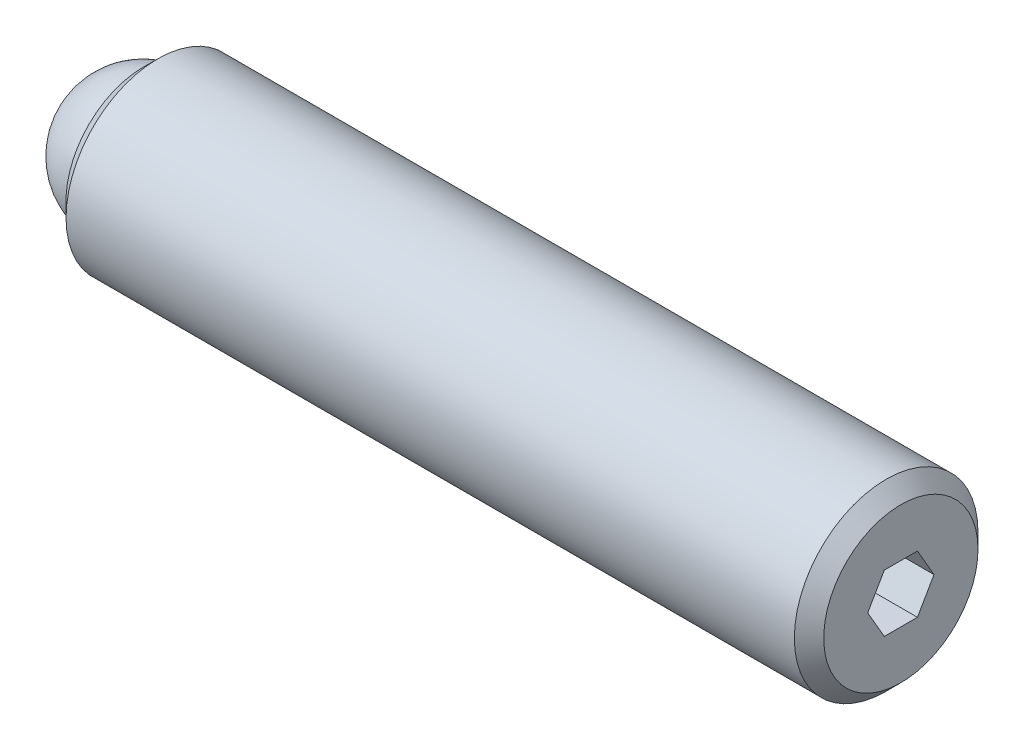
ISO-10303-21;
HEADER;
FILE_DESCRIPTION(('STEP AP214'),'2;1');
FILE_NAME('part.step','',(''),(''),'','','');
FILE_SCHEMA(('AUTOMOTIVE_DESIGN { 1 0 10303 214 1 1 1 1 }'));
ENDSEC;
DATA;
#1=APPLICATION_CONTEXT('core data for automotive mechanical design processes');
#2=APPLICATION_PROTOCOL_DEFINITION('international standard','automotive_design',2000,#1);
#3=PRODUCT_CONTEXT('',#1,'mechanical');
#4=PRODUCT('Part','Part','',(#3));
#5=PRODUCT_RELATED_PRODUCT_CATEGORY('part','',(#4));
#6=PRODUCT_DEFINITION_FORMATION('','',#4);
#7=PRODUCT_DEFINITION_CONTEXT('part definition',#1,'design');
#8=PRODUCT_DEFINITION('design','',#6,#7);
#9=PRODUCT_DEFINITION_SHAPE('','',#8);
#10=(LENGTH_UNIT() NAMED_UNIT(*) SI_UNIT(.MILLI.,.METRE.));
#11=(NAMED_UNIT(*) PLANE_ANGLE_UNIT() SI_UNIT($,.RADIAN.));
#12=(NAMED_UNIT(*) SI_UNIT($,.STERADIAN.) SOLID_ANGLE_UNIT());
#13=UNCERTAINTY_MEASURE_WITH_UNIT(LENGTH_MEASURE(1.E-05),#10,'distance_accuracy_value','');
#14=(GEOMETRIC_REPRESENTATION_CONTEXT(3) GLOBAL_UNCERTAINTY_ASSIGNED_CONTEXT((#13)) GLOBAL_UNIT_ASSIGNED_CONTEXT((#10,
#11,#12)) REPRESENTATION_CONTEXT('',''));
#15=CARTESIAN_POINT('',(0.,0.,0.));
#16=DIRECTION('',(0.,0.,1.));
#17=DIRECTION('',(1.,0.,0.));
#18=AXIS2_PLACEMENT_3D('',#15,#16,#17);
#19=CARTESIAN_POINT('',(0.,0.,0.));
#20=DIRECTION('',(0.,-1.,0.));
#21=DIRECTION('',(0.,0.,1.));
#22=AXIS2_PLACEMENT_3D('',#19,#20,#21);
#23=SPHERICAL_SURFACE('',#22,2.38125);
#24=CARTESIAN_POINT('',(0.,-2.38125,0.));
#25=VERTEX_POINT('',#24);
#26=VERTEX_LOOP('',#25);
#27=FACE_BOUND('',#26,.T.);
#28=ADVANCED_FACE('F41',(#27),#23,.T.);
#29=CLOSED_SHELL('',(#28));
#30=MANIFOLD_SOLID_BREP('B2',#29);
#31=CARTESIAN_POINT('',(26.19375,0.,0.));
#32=DIRECTION('',(-1.,0.,0.));
#33=DIRECTION('',(0.,0.,1.));
#34=AXIS2_PLACEMENT_3D('',#31,#32,#33);
#35=CYLINDRICAL_SURFACE('',#34,3.175);
#36=CARTESIAN_POINT('',(25.68575,0.,0.));
#37=DIRECTION('',(1.,0.,0.));
#38=DIRECTION('',(0.,0.,-1.));
#39=AXIS2_PLACEMENT_3D('',#36,#37,#38);
#40=CIRCLE('',#39,3.175);
#41=CARTESIAN_POINT('',(25.68575,0.,-3.175));
#42=VERTEX_POINT('',#41);
#43=EDGE_CURVE('E39',#42,#42,#40,.F.);
#44=ORIENTED_EDGE('',*,*,#43,.T.);
#45=EDGE_LOOP('',(#44));
#46=FACE_BOUND('',#45,.T.);
#47=CARTESIAN_POINT('',(0.508000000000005,0.,0.));
#48=DIRECTION('',(1.,0.,0.));
#49=DIRECTION('',(0.,0.,-1.));
#50=AXIS2_PLACEMENT_3D('',#47,#48,#49);
#51=CIRCLE('',#50,3.175);
#52=CARTESIAN_POINT('',(0.508000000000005,0.,-3.175));
#53=VERTEX_POINT('',#52);
#54=EDGE_CURVE('E157',#53,#53,#51,.T.);
#55=ORIENTED_EDGE('',*,*,#54,.T.);
#56=EDGE_LOOP('',(#55));
#57=FACE_BOUND('',#56,.T.);
#58=ADVANCED_FACE('F54',(#46,#57),#35,.T.);
#59=CARTESIAN_POINT('',(26.19375,0.,0.));
#60=DIRECTION('',(1.,0.,0.));
#61=DIRECTION('',(0.,0.,-1.));
#62=AXIS2_PLACEMENT_3D('',#59,#60,#61);
#63=PLANE('',#62);
#64=DIRECTION('',(0.,0.866025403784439,-0.5));
#65=VECTOR('',#64,1.);
#66=CARTESIAN_POINT('',(26.19375,-0.9921875,-0.572839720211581));
#67=LINE('',#66,#65);
#68=CARTESIAN_POINT('',(26.19375,-0.9921875,-0.572839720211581));
#69=VERTEX_POINT('',#68);
#70=CARTESIAN_POINT('',(26.19375,0.,-1.14567944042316));
#71=VERTEX_POINT('',#70);
#72=EDGE_CURVE('E69',#69,#71,#67,.T.);
#73=ORIENTED_EDGE('',*,*,#72,.F.);
#74=DIRECTION('',(0.,0.,-1.));
#75=VECTOR('',#74,1.);
#76=CARTESIAN_POINT('',(26.19375,-0.9921875,0.572839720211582));
#77=LINE('',#76,#75);
#78=CARTESIAN_POINT('',(26.19375,-0.9921875,0.572839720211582));
#79=VERTEX_POINT('',#78);
#80=EDGE_CURVE('E153',#79,#69,#77,.T.);
#81=ORIENTED_EDGE('',*,*,#80,.F.);
#82=DIRECTION('',(0.,-0.866025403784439,-0.5));
#83=VECTOR('',#82,1.);
#84=CARTESIAN_POINT('',(26.19375,0.,1.14567944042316));
#85=LINE('',#84,#83);
#86=CARTESIAN_POINT('',(26.19375,0.,1.14567944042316));
#87=VERTEX_POINT('',#86);
#88=EDGE_CURVE('E151',#87,#79,#85,.T.);
#89=ORIENTED_EDGE('',*,*,#88,.F.);
#90=DIRECTION('',(0.,-0.866025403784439,0.5));
#91=VECTOR('',#90,1.);
#92=CARTESIAN_POINT('',(26.19375,0.992187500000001,0.572839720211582));
#93=LINE('',#92,#91);
#94=CARTESIAN_POINT('',(26.19375,0.992187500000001,0.572839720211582));
#95=VERTEX_POINT('',#94);
#96=EDGE_CURVE('E117',#95,#87,#93,.T.);
#97=ORIENTED_EDGE('',*,*,#96,.F.);
#98=DIRECTION('',(0.,0.,1.));
#99=VECTOR('',#98,1.);
#100=CARTESIAN_POINT('',(26.19375,0.9921875,-0.572839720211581));
#101=LINE('',#100,#99);
#102=CARTESIAN_POINT('',(26.19375,0.9921875,-0.572839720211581));
#103=VERTEX_POINT('',#102);
#104=EDGE_CURVE('E147',#103,#95,#101,.T.);
#105=ORIENTED_EDGE('',*,*,#104,.F.);
#106=DIRECTION('',(0.,0.866025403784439,0.5));
#107=VECTOR('',#106,1.);
#108=CARTESIAN_POINT('',(26.19375,0.,-1.14567944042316));
#109=LINE('',#108,#107);
#110=EDGE_CURVE('E143',#71,#103,#109,.T.);
#111=ORIENTED_EDGE('',*,*,#110,.F.);
#112=EDGE_LOOP('',(#73,#81,#89,#97,#105,#111));
#113=FACE_BOUND('',#112,.T.);
#114=CARTESIAN_POINT('',(26.19375,0.,0.));
#115=DIRECTION('',(1.,0.,0.));
#116=DIRECTION('',(0.,0.,-1.));
#117=AXIS2_PLACEMENT_3D('',#114,#115,#116);
#118=CIRCLE('',#117,2.667);
#119=CARTESIAN_POINT('',(26.19375,0.,-2.667));
#120=VERTEX_POINT('',#119);
#121=EDGE_CURVE('E62',#120,#120,#118,.T.);
#122=ORIENTED_EDGE('',*,*,#121,.T.);
#123=EDGE_LOOP('',(#122));
#124=FACE_BOUND('',#123,.T.);
#125=ADVANCED_FACE('F170',(#113,#124),#63,.T.);
#126=CARTESIAN_POINT('',(0.,0.,0.));
#127=DIRECTION('',(1.,0.,0.));
#128=DIRECTION('',(0.,0.,-1.));
#129=AXIS2_PLACEMENT_3D('',#126,#127,#128);
#130=PLANE('',#129);
#131=CARTESIAN_POINT('',(0.,0.,0.));
#132=DIRECTION('',(-1.,0.,0.));
#133=DIRECTION('',(0.,0.,1.));
#134=AXIS2_PLACEMENT_3D('',#131,#132,#133);
#135=CIRCLE('',#134,2.38125);
#136=CARTESIAN_POINT('',(0.,0.,2.38125));
#137=VERTEX_POINT('',#136);
#138=EDGE_CURVE('E225',#137,#137,#135,.T.);
#139=ORIENTED_EDGE('',*,*,#138,.F.);
#140=EDGE_LOOP('',(#139));
#141=FACE_BOUND('',#140,.T.);
#142=CARTESIAN_POINT('',(0.,0.,0.));
#143=DIRECTION('',(1.,0.,0.));
#144=DIRECTION('',(0.,0.,-1.));
#145=AXIS2_PLACEMENT_3D('',#142,#143,#144);
#146=CIRCLE('',#145,2.667);
#147=CARTESIAN_POINT('',(0.,0.,-2.667));
#148=VERTEX_POINT('',#147);
#149=EDGE_CURVE('E165',#148,#148,#146,.F.);
#150=ORIENTED_EDGE('',*,*,#149,.T.);
#151=EDGE_LOOP('',(#150));
#152=FACE_BOUND('',#151,.T.);
#153=ADVANCED_FACE('F182',(#141,#152),#130,.F.);
#154=CARTESIAN_POINT('',(0.508000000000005,0.,0.));
#155=DIRECTION('',(1.,0.,0.));
#156=DIRECTION('',(0.,0.,-1.));
#157=AXIS2_PLACEMENT_3D('',#154,#155,#156);
#158=CONICAL_SURFACE('',#157,3.175,0.785398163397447);
#159=ORIENTED_EDGE('',*,*,#149,.F.);
#160=EDGE_LOOP('',(#159));
#161=FACE_BOUND('',#160,.T.);
#162=ORIENTED_EDGE('',*,*,#54,.F.);
#163=EDGE_LOOP('',(#162));
#164=FACE_BOUND('',#163,.T.);
#165=ADVANCED_FACE('F174',(#161,#164),#158,.T.);
#166=CARTESIAN_POINT('',(26.19375,0.,0.));
#167=DIRECTION('',(-1.,0.,0.));
#168=DIRECTION('',(0.,0.,1.));
#169=AXIS2_PLACEMENT_3D('',#166,#167,#168);
#170=CONICAL_SURFACE('',#169,2.667,0.785398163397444);
#171=ORIENTED_EDGE('',*,*,#43,.F.);
#172=EDGE_LOOP('',(#171));
#173=FACE_BOUND('',#172,.T.);
#174=ORIENTED_EDGE('',*,*,#121,.F.);
#175=EDGE_LOOP('',(#174));
#176=FACE_BOUND('',#175,.T.);
#177=ADVANCED_FACE('F56',(#173,#176),#170,.T.);
#178=CARTESIAN_POINT('',(23.90775,-0.9921875,-0.572839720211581));
#179=DIRECTION('',(0.,-0.5,-0.866025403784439));
#180=DIRECTION('',(0.,0.866025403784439,-0.5));
#181=AXIS2_PLACEMENT_3D('',#178,#179,#180);
#182=PLANE('',#181);
#183=ORIENTED_EDGE('',*,*,#72,.T.);
#184=DIRECTION('',(1.,0.,0.));
#185=VECTOR('',#184,1.);
#186=CARTESIAN_POINT('',(23.90775,0.,-1.14567944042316));
#187=LINE('',#186,#185);
#188=CARTESIAN_POINT('',(23.90775,0.,-1.14567944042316));
#189=VERTEX_POINT('',#188);
#190=EDGE_CURVE('E99',#189,#71,#187,.T.);
#191=ORIENTED_EDGE('',*,*,#190,.F.);
#192=DIRECTION('',(0.,0.866025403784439,-0.5));
#193=VECTOR('',#192,1.);
#194=CARTESIAN_POINT('',(23.90775,-0.9921875,-0.572839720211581));
#195=LINE('',#194,#193);
#196=CARTESIAN_POINT('',(23.90775,-0.9921875,-0.572839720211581));
#197=VERTEX_POINT('',#196);
#198=EDGE_CURVE('E155',#197,#189,#195,.T.);
#199=ORIENTED_EDGE('',*,*,#198,.F.);
#200=DIRECTION('',(1.,0.,0.));
#201=VECTOR('',#200,1.);
#202=CARTESIAN_POINT('',(23.90775,-0.9921875,-0.572839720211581));
#203=LINE('',#202,#201);
#204=EDGE_CURVE('E77',#197,#69,#203,.T.);
#205=ORIENTED_EDGE('',*,*,#204,.T.);
#206=EDGE_LOOP('',(#183,#191,#199,#205));
#207=FACE_BOUND('',#206,.T.);
#208=ADVANCED_FACE('F173',(#207),#182,.F.);
#209=CARTESIAN_POINT('',(23.90775,-0.9921875,0.572839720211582));
#210=DIRECTION('',(0.,-1.,0.));
#211=DIRECTION('',(0.,0.,-1.));
#212=AXIS2_PLACEMENT_3D('',#209,#210,#211);
#213=PLANE('',#212);
#214=ORIENTED_EDGE('',*,*,#80,.T.);
#215=ORIENTED_EDGE('',*,*,#204,.F.);
#216=DIRECTION('',(0.,0.,-1.));
#217=VECTOR('',#216,1.);
#218=CARTESIAN_POINT('',(23.90775,-0.9921875,0.572839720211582));
#219=LINE('',#218,#217);
#220=CARTESIAN_POINT('',(23.90775,-0.9921875,0.572839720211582));
#221=VERTEX_POINT('',#220);
#222=EDGE_CURVE('E129',#221,#197,#219,.T.);
#223=ORIENTED_EDGE('',*,*,#222,.F.);
#224=DIRECTION('',(1.,0.,0.));
#225=VECTOR('',#224,1.);
#226=CARTESIAN_POINT('',(23.90775,-0.9921875,0.572839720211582));
#227=LINE('',#226,#225);
#228=EDGE_CURVE('E121',#221,#79,#227,.T.);
#229=ORIENTED_EDGE('',*,*,#228,.T.);
#230=EDGE_LOOP('',(#214,#215,#223,#229));
#231=FACE_BOUND('',#230,.T.);
#232=ADVANCED_FACE('F180',(#231),#213,.F.);
#233=CARTESIAN_POINT('',(23.90775,0.,1.14567944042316));
#234=DIRECTION('',(0.,-0.5,0.866025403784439));
#235=DIRECTION('',(0.,-0.866025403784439,-0.5));
#236=AXIS2_PLACEMENT_3D('',#233,#234,#235);
#237=PLANE('',#236);
#238=ORIENTED_EDGE('',*,*,#88,.T.);
#239=ORIENTED_EDGE('',*,*,#228,.F.);
#240=DIRECTION('',(0.,-0.866025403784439,-0.5));
#241=VECTOR('',#240,1.);
#242=CARTESIAN_POINT('',(23.90775,0.,1.14567944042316));
#243=LINE('',#242,#241);
#244=CARTESIAN_POINT('',(23.90775,0.,1.14567944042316));
#245=VERTEX_POINT('',#244);
#246=EDGE_CURVE('E125',#245,#221,#243,.T.);
#247=ORIENTED_EDGE('',*,*,#246,.F.);
#248=DIRECTION('',(1.,0.,0.));
#249=VECTOR('',#248,1.);
#250=CARTESIAN_POINT('',(23.90775,0.,1.14567944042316));
#251=LINE('',#250,#249);
#252=EDGE_CURVE('E110',#245,#87,#251,.T.);
#253=ORIENTED_EDGE('',*,*,#252,.T.);
#254=EDGE_LOOP('',(#238,#239,#247,#253));
#255=FACE_BOUND('',#254,.T.);
#256=ADVANCED_FACE('F126',(#255),#237,.F.);
#257=CARTESIAN_POINT('',(23.90775,0.992187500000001,0.572839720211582));
#258=DIRECTION('',(0.,0.5,0.866025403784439));
#259=DIRECTION('',(0.,-0.866025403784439,0.5));
#260=AXIS2_PLACEMENT_3D('',#257,#258,#259);
#261=PLANE('',#260);
#262=ORIENTED_EDGE('',*,*,#96,.T.);
#263=ORIENTED_EDGE('',*,*,#252,.F.);
#264=DIRECTION('',(0.,-0.866025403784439,0.5));
#265=VECTOR('',#264,1.);
#266=CARTESIAN_POINT('',(23.90775,0.992187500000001,0.572839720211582));
#267=LINE('',#266,#265);
#268=CARTESIAN_POINT('',(23.90775,0.992187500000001,0.572839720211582));
#269=VERTEX_POINT('',#268);
#270=EDGE_CURVE('E114',#269,#245,#267,.T.);
#271=ORIENTED_EDGE('',*,*,#270,.F.);
#272=DIRECTION('',(1.,0.,0.));
#273=VECTOR('',#272,1.);
#274=CARTESIAN_POINT('',(23.90775,0.992187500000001,0.572839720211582));
#275=LINE('',#274,#273);
#276=EDGE_CURVE('E122',#269,#95,#275,.T.);
#277=ORIENTED_EDGE('',*,*,#276,.T.);
#278=EDGE_LOOP('',(#262,#263,#271,#277));
#279=FACE_BOUND('',#278,.T.);
#280=ADVANCED_FACE('F112',(#279),#261,.F.);
#281=CARTESIAN_POINT('',(23.90775,0.9921875,-0.572839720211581));
#282=DIRECTION('',(0.,1.,0.));
#283=DIRECTION('',(0.,0.,1.));
#284=AXIS2_PLACEMENT_3D('',#281,#282,#283);
#285=PLANE('',#284);
#286=ORIENTED_EDGE('',*,*,#104,.T.);
#287=ORIENTED_EDGE('',*,*,#276,.F.);
#288=DIRECTION('',(0.,0.,1.));
#289=VECTOR('',#288,1.);
#290=CARTESIAN_POINT('',(23.90775,0.9921875,-0.572839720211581));
#291=LINE('',#290,#289);
#292=CARTESIAN_POINT('',(23.90775,0.9921875,-0.572839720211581));
#293=VERTEX_POINT('',#292);
#294=EDGE_CURVE('E135',#293,#269,#291,.T.);
#295=ORIENTED_EDGE('',*,*,#294,.F.);
#296=DIRECTION('',(1.,0.,0.));
#297=VECTOR('',#296,1.);
#298=CARTESIAN_POINT('',(23.90775,0.9921875,-0.572839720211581));
#299=LINE('',#298,#297);
#300=EDGE_CURVE('E160',#293,#103,#299,.T.);
#301=ORIENTED_EDGE('',*,*,#300,.T.);
#302=EDGE_LOOP('',(#286,#287,#295,#301));
#303=FACE_BOUND('',#302,.T.);
#304=ADVANCED_FACE('F201',(#303),#285,.F.);
#305=CARTESIAN_POINT('',(23.90775,0.,-1.14567944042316));
#306=DIRECTION('',(0.,0.5,-0.866025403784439));
#307=DIRECTION('',(0.,0.866025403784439,0.5));
#308=AXIS2_PLACEMENT_3D('',#305,#306,#307);
#309=PLANE('',#308);
#310=ORIENTED_EDGE('',*,*,#110,.T.);
#311=ORIENTED_EDGE('',*,*,#300,.F.);
#312=DIRECTION('',(0.,0.866025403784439,0.5));
#313=VECTOR('',#312,1.);
#314=CARTESIAN_POINT('',(23.90775,0.,-1.14567944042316));
#315=LINE('',#314,#313);
#316=EDGE_CURVE('E137',#189,#293,#315,.T.);
#317=ORIENTED_EDGE('',*,*,#316,.F.);
#318=ORIENTED_EDGE('',*,*,#190,.T.);
#319=EDGE_LOOP('',(#310,#311,#317,#318));
#320=FACE_BOUND('',#319,.T.);
#321=ADVANCED_FACE('F198',(#320),#309,.F.);
#322=CARTESIAN_POINT('',(23.90775,0.,0.));
#323=DIRECTION('',(1.,0.,0.));
#324=DIRECTION('',(0.,0.,-1.));
#325=AXIS2_PLACEMENT_3D('',#322,#323,#324);
#326=PLANE('',#325);
#327=ORIENTED_EDGE('',*,*,#198,.T.);
#328=ORIENTED_EDGE('',*,*,#316,.T.);
#329=ORIENTED_EDGE('',*,*,#294,.T.);
#330=ORIENTED_EDGE('',*,*,#270,.T.);
#331=ORIENTED_EDGE('',*,*,#246,.T.);
#332=ORIENTED_EDGE('',*,*,#222,.T.);
#333=EDGE_LOOP('',(#327,#328,#329,#330,#331,#332));
#334=FACE_BOUND('',#333,.T.);
#335=ADVANCED_FACE('F132',(#334),#326,.T.);
#336=CARTESIAN_POINT('',(1.984375,0.,0.));
#337=DIRECTION('',(-1.,0.,0.));
#338=DIRECTION('',(0.,0.,1.));
#339=AXIS2_PLACEMENT_3D('',#336,#337,#338);
#340=CYLINDRICAL_SURFACE('',#339,2.38125);
#341=CARTESIAN_POINT('',(1.984375,0.,0.));
#342=DIRECTION('',(-1.,0.,0.));
#343=DIRECTION('',(0.,0.,1.));
#344=AXIS2_PLACEMENT_3D('',#341,#342,#343);
#345=CIRCLE('',#344,2.38125);
#346=CARTESIAN_POINT('',(1.984375,0.,2.38125));
#347=VERTEX_POINT('',#346);
#348=EDGE_CURVE('E144',#347,#347,#345,.T.);
#349=ORIENTED_EDGE('',*,*,#348,.F.);
#350=EDGE_LOOP('',(#349));
#351=FACE_BOUND('',#350,.T.);
#352=ORIENTED_EDGE('',*,*,#138,.T.);
#353=EDGE_LOOP('',(#352));
#354=FACE_BOUND('',#353,.T.);
#355=ADVANCED_FACE('F214',(#351,#354),#340,.F.);
#356=CARTESIAN_POINT('',(1.984375,0.,0.));
#357=DIRECTION('',(-1.,0.,0.));
#358=DIRECTION('',(0.,0.,1.));
#359=AXIS2_PLACEMENT_3D('',#356,#357,#358);
#360=PLANE('',#359);
#361=ORIENTED_EDGE('',*,*,#348,.T.);
#362=EDGE_LOOP('',(#361));
#363=FACE_BOUND('',#362,.T.);
#364=ADVANCED_FACE('F217',(#363),#360,.T.);
#365=CLOSED_SHELL('',(#58,#125,#153,#165,#177,#208,#232,#256,#280,#304,#321,#335,#355,#364));
#366=MANIFOLD_SOLID_BREP('B6',#365);
#367=ADVANCED_BREP_SHAPE_REPRESENTATION('',(#18,#30,#366),#14);
#368=SHAPE_DEFINITION_REPRESENTATION(#9,#367);
ENDSEC;
END-ISO-10303-21;
